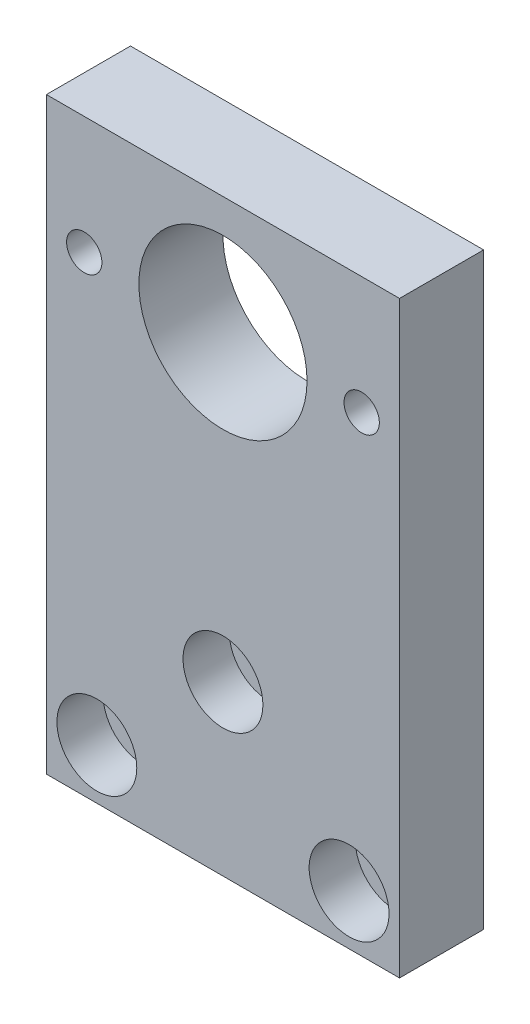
ISO-10303-21;
HEADER;
FILE_DESCRIPTION(('STEP AP214'),'2;1');
FILE_NAME('part.step','',(''),(''),'','','');
FILE_SCHEMA(('AUTOMOTIVE_DESIGN { 1 0 10303 214 1 1 1 1 }'));
ENDSEC;
DATA;
#1=APPLICATION_CONTEXT('core data for automotive mechanical design processes');
#2=APPLICATION_PROTOCOL_DEFINITION('international standard','automotive_design',2000,#1);
#3=PRODUCT_CONTEXT('',#1,'mechanical');
#4=PRODUCT('Part','Part','',(#3));
#5=PRODUCT_RELATED_PRODUCT_CATEGORY('part','',(#4));
#6=PRODUCT_DEFINITION_FORMATION('','',#4);
#7=PRODUCT_DEFINITION_CONTEXT('part definition',#1,'design');
#8=PRODUCT_DEFINITION('design','',#6,#7);
#9=PRODUCT_DEFINITION_SHAPE('','',#8);
#10=(LENGTH_UNIT() NAMED_UNIT(*) SI_UNIT(.MILLI.,.METRE.));
#11=(NAMED_UNIT(*) PLANE_ANGLE_UNIT() SI_UNIT($,.RADIAN.));
#12=(NAMED_UNIT(*) SI_UNIT($,.STERADIAN.) SOLID_ANGLE_UNIT());
#13=UNCERTAINTY_MEASURE_WITH_UNIT(LENGTH_MEASURE(1.E-05),#10,'distance_accuracy_value','');
#14=(GEOMETRIC_REPRESENTATION_CONTEXT(3) GLOBAL_UNCERTAINTY_ASSIGNED_CONTEXT((#13)) GLOBAL_UNIT_ASSIGNED_CONTEXT((#10,
#11,#12)) REPRESENTATION_CONTEXT('',''));
#15=CARTESIAN_POINT('',(0.,0.,0.));
#16=DIRECTION('',(0.,0.,1.));
#17=DIRECTION('',(1.,0.,0.));
#18=AXIS2_PLACEMENT_3D('',#15,#16,#17);
#19=CARTESIAN_POINT('',(21.,19.9999999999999,10.));
#20=DIRECTION('',(0.,0.,-1.));
#21=DIRECTION('',(-1.,0.,0.));
#22=AXIS2_PLACEMENT_3D('',#19,#20,#21);
#23=CYLINDRICAL_SURFACE('',#22,2.75);
#24=CARTESIAN_POINT('',(21.,19.9999999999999,0.));
#25=DIRECTION('',(0.,0.,1.));
#26=DIRECTION('',(1.,0.,0.));
#27=AXIS2_PLACEMENT_3D('',#24,#25,#26);
#28=CIRCLE('',#27,2.75);
#29=CARTESIAN_POINT('',(23.75,19.9999999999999,0.));
#30=VERTEX_POINT('',#29);
#31=EDGE_CURVE('E149',#30,#30,#28,.T.);
#32=ORIENTED_EDGE('',*,*,#31,.F.);
#33=EDGE_LOOP('',(#32));
#34=FACE_BOUND('',#33,.T.);
#35=CARTESIAN_POINT('',(21.,19.9999999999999,4.5));
#36=DIRECTION('',(0.,0.,1.));
#37=DIRECTION('',(1.,0.,0.));
#38=AXIS2_PLACEMENT_3D('',#35,#36,#37);
#39=CIRCLE('',#38,2.75);
#40=CARTESIAN_POINT('',(23.75,19.9999999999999,4.5));
#41=VERTEX_POINT('',#40);
#42=EDGE_CURVE('E36',#41,#41,#39,.T.);
#43=ORIENTED_EDGE('',*,*,#42,.T.);
#44=EDGE_LOOP('',(#43));
#45=FACE_BOUND('',#44,.T.);
#46=ADVANCED_FACE('F32',(#34,#45),#23,.F.);
#47=CARTESIAN_POINT('',(36.,5.99999999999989,10.));
#48=DIRECTION('',(0.,0.,-1.));
#49=DIRECTION('',(-1.,0.,0.));
#50=AXIS2_PLACEMENT_3D('',#47,#48,#49);
#51=CYLINDRICAL_SURFACE('',#50,2.75);
#52=CARTESIAN_POINT('',(36.,5.99999999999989,0.));
#53=DIRECTION('',(0.,0.,1.));
#54=DIRECTION('',(1.,0.,0.));
#55=AXIS2_PLACEMENT_3D('',#52,#53,#54);
#56=CIRCLE('',#55,2.75);
#57=CARTESIAN_POINT('',(38.75,5.99999999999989,0.));
#58=VERTEX_POINT('',#57);
#59=EDGE_CURVE('E154',#58,#58,#56,.T.);
#60=ORIENTED_EDGE('',*,*,#59,.F.);
#61=EDGE_LOOP('',(#60));
#62=FACE_BOUND('',#61,.T.);
#63=CARTESIAN_POINT('',(36.,5.99999999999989,4.5));
#64=DIRECTION('',(0.,0.,1.));
#65=DIRECTION('',(1.,0.,0.));
#66=AXIS2_PLACEMENT_3D('',#63,#64,#65);
#67=CIRCLE('',#66,2.75);
#68=CARTESIAN_POINT('',(38.75,5.99999999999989,4.5));
#69=VERTEX_POINT('',#68);
#70=EDGE_CURVE('E113',#69,#69,#67,.T.);
#71=ORIENTED_EDGE('',*,*,#70,.T.);
#72=EDGE_LOOP('',(#71));
#73=FACE_BOUND('',#72,.T.);
#74=ADVANCED_FACE('F166',(#62,#73),#51,.F.);
#75=CARTESIAN_POINT('',(6.,5.99999999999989,10.));
#76=DIRECTION('',(0.,0.,-1.));
#77=DIRECTION('',(-1.,0.,0.));
#78=AXIS2_PLACEMENT_3D('',#75,#76,#77);
#79=CYLINDRICAL_SURFACE('',#78,2.75);
#80=CARTESIAN_POINT('',(6.,5.99999999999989,0.));
#81=DIRECTION('',(0.,0.,1.));
#82=DIRECTION('',(1.,0.,0.));
#83=AXIS2_PLACEMENT_3D('',#80,#81,#82);
#84=CIRCLE('',#83,2.75);
#85=CARTESIAN_POINT('',(8.75,5.99999999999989,0.));
#86=VERTEX_POINT('',#85);
#87=EDGE_CURVE('E103',#86,#86,#84,.T.);
#88=ORIENTED_EDGE('',*,*,#87,.F.);
#89=EDGE_LOOP('',(#88));
#90=FACE_BOUND('',#89,.T.);
#91=CARTESIAN_POINT('',(6.,5.99999999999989,4.5));
#92=DIRECTION('',(0.,0.,1.));
#93=DIRECTION('',(1.,0.,0.));
#94=AXIS2_PLACEMENT_3D('',#91,#92,#93);
#95=CIRCLE('',#94,2.75);
#96=CARTESIAN_POINT('',(8.75,5.99999999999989,4.5));
#97=VERTEX_POINT('',#96);
#98=EDGE_CURVE('E109',#97,#97,#95,.T.);
#99=ORIENTED_EDGE('',*,*,#98,.T.);
#100=EDGE_LOOP('',(#99));
#101=FACE_BOUND('',#100,.T.);
#102=ADVANCED_FACE('F163',(#90,#101),#79,.F.);
#103=CARTESIAN_POINT('',(42.,-1.13686837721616E-13,10.));
#104=DIRECTION('',(0.,0.,1.));
#105=DIRECTION('',(1.,0.,0.));
#106=AXIS2_PLACEMENT_3D('',#103,#104,#105);
#107=PLANE('',#106);
#108=CARTESIAN_POINT('',(21.,19.9999999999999,10.));
#109=DIRECTION('',(0.,0.,1.));
#110=DIRECTION('',(1.,0.,0.));
#111=AXIS2_PLACEMENT_3D('',#108,#109,#110);
#112=CIRCLE('',#111,4.75);
#113=CARTESIAN_POINT('',(25.75,19.9999999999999,10.));
#114=VERTEX_POINT('',#113);
#115=EDGE_CURVE('E129',#114,#114,#112,.T.);
#116=ORIENTED_EDGE('',*,*,#115,.F.);
#117=EDGE_LOOP('',(#116));
#118=FACE_BOUND('',#117,.T.);
#119=CARTESIAN_POINT('',(36.,5.99999999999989,10.));
#120=DIRECTION('',(0.,0.,1.));
#121=DIRECTION('',(1.,0.,0.));
#122=AXIS2_PLACEMENT_3D('',#119,#120,#121);
#123=CIRCLE('',#122,4.75);
#124=CARTESIAN_POINT('',(40.75,5.99999999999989,10.));
#125=VERTEX_POINT('',#124);
#126=EDGE_CURVE('E122',#125,#125,#123,.T.);
#127=ORIENTED_EDGE('',*,*,#126,.F.);
#128=EDGE_LOOP('',(#127));
#129=FACE_BOUND('',#128,.T.);
#130=CARTESIAN_POINT('',(6.,5.99999999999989,10.));
#131=DIRECTION('',(0.,0.,1.));
#132=DIRECTION('',(1.,0.,0.));
#133=AXIS2_PLACEMENT_3D('',#130,#131,#132);
#134=CIRCLE('',#133,4.75);
#135=CARTESIAN_POINT('',(10.75,5.99999999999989,10.));
#136=VERTEX_POINT('',#135);
#137=EDGE_CURVE('E115',#136,#136,#134,.T.);
#138=ORIENTED_EDGE('',*,*,#137,.F.);
#139=EDGE_LOOP('',(#138));
#140=FACE_BOUND('',#139,.T.);
#141=CARTESIAN_POINT('',(37.5,55.9999999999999,10.));
#142=DIRECTION('',(0.,0.,1.));
#143=DIRECTION('',(1.,0.,0.));
#144=AXIS2_PLACEMENT_3D('',#141,#142,#143);
#145=CIRCLE('',#144,2.1);
#146=CARTESIAN_POINT('',(39.6,55.9999999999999,10.));
#147=VERTEX_POINT('',#146);
#148=EDGE_CURVE('E140',#147,#147,#145,.T.);
#149=ORIENTED_EDGE('',*,*,#148,.F.);
#150=EDGE_LOOP('',(#149));
#151=FACE_BOUND('',#150,.T.);
#152=DIRECTION('',(1.,0.,0.));
#153=VECTOR('',#152,1.);
#154=CARTESIAN_POINT('',(0.,-1.13686837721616E-13,10.));
#155=LINE('',#154,#153);
#156=CARTESIAN_POINT('',(0.,-1.13686837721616E-13,10.));
#157=VERTEX_POINT('',#156);
#158=CARTESIAN_POINT('',(42.,-1.13686837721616E-13,10.));
#159=VERTEX_POINT('',#158);
#160=EDGE_CURVE('E87',#157,#159,#155,.T.);
#161=ORIENTED_EDGE('',*,*,#160,.T.);
#162=DIRECTION('',(0.,1.,0.));
#163=VECTOR('',#162,1.);
#164=CARTESIAN_POINT('',(42.,-1.13686837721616E-13,10.));
#165=LINE('',#164,#163);
#166=CARTESIAN_POINT('',(42.,69.9999999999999,10.));
#167=VERTEX_POINT('',#166);
#168=EDGE_CURVE('E81',#159,#167,#165,.T.);
#169=ORIENTED_EDGE('',*,*,#168,.T.);
#170=DIRECTION('',(-1.,0.,0.));
#171=VECTOR('',#170,1.);
#172=CARTESIAN_POINT('',(0.,69.9999999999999,10.));
#173=LINE('',#172,#171);
#174=CARTESIAN_POINT('',(0.,69.9999999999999,10.));
#175=VERTEX_POINT('',#174);
#176=EDGE_CURVE('E85',#167,#175,#173,.T.);
#177=ORIENTED_EDGE('',*,*,#176,.T.);
#178=DIRECTION('',(0.,-1.,0.));
#179=VECTOR('',#178,1.);
#180=CARTESIAN_POINT('',(0.,-1.13686837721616E-13,10.));
#181=LINE('',#180,#179);
#182=EDGE_CURVE('E51',#175,#157,#181,.T.);
#183=ORIENTED_EDGE('',*,*,#182,.T.);
#184=EDGE_LOOP('',(#161,#169,#177,#183));
#185=FACE_BOUND('',#184,.T.);
#186=CARTESIAN_POINT('',(4.5,55.9999999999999,10.));
#187=DIRECTION('',(0.,0.,1.));
#188=DIRECTION('',(1.,0.,0.));
#189=AXIS2_PLACEMENT_3D('',#186,#187,#188);
#190=CIRCLE('',#189,2.1);
#191=CARTESIAN_POINT('',(6.6,55.9999999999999,10.));
#192=VERTEX_POINT('',#191);
#193=EDGE_CURVE('E146',#192,#192,#190,.T.);
#194=ORIENTED_EDGE('',*,*,#193,.F.);
#195=EDGE_LOOP('',(#194));
#196=FACE_BOUND('',#195,.T.);
#197=CARTESIAN_POINT('',(21.,55.9999999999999,10.));
#198=DIRECTION('',(0.,0.,1.));
#199=DIRECTION('',(1.,0.,0.));
#200=AXIS2_PLACEMENT_3D('',#197,#198,#199);
#201=CIRCLE('',#200,10.);
#202=CARTESIAN_POINT('',(31.,55.9999999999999,10.));
#203=VERTEX_POINT('',#202);
#204=EDGE_CURVE('E134',#203,#203,#201,.T.);
#205=ORIENTED_EDGE('',*,*,#204,.F.);
#206=EDGE_LOOP('',(#205));
#207=FACE_BOUND('',#206,.T.);
#208=ADVANCED_FACE('F82',(#118,#129,#140,#151,#185,#196,#207),#107,.T.);
#209=CARTESIAN_POINT('',(42.,-1.13686837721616E-13,0.));
#210=DIRECTION('',(0.,0.,1.));
#211=DIRECTION('',(1.,0.,0.));
#212=AXIS2_PLACEMENT_3D('',#209,#210,#211);
#213=PLANE('',#212);
#214=CARTESIAN_POINT('',(37.5,55.9999999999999,0.));
#215=DIRECTION('',(0.,0.,1.));
#216=DIRECTION('',(1.,0.,0.));
#217=AXIS2_PLACEMENT_3D('',#214,#215,#216);
#218=CIRCLE('',#217,2.1);
#219=CARTESIAN_POINT('',(39.6,55.9999999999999,0.));
#220=VERTEX_POINT('',#219);
#221=EDGE_CURVE('E137',#220,#220,#218,.T.);
#222=ORIENTED_EDGE('',*,*,#221,.T.);
#223=EDGE_LOOP('',(#222));
#224=FACE_BOUND('',#223,.T.);
#225=ORIENTED_EDGE('',*,*,#31,.T.);
#226=EDGE_LOOP('',(#225));
#227=FACE_BOUND('',#226,.T.);
#228=ORIENTED_EDGE('',*,*,#87,.T.);
#229=EDGE_LOOP('',(#228));
#230=FACE_BOUND('',#229,.T.);
#231=DIRECTION('',(1.,0.,0.));
#232=VECTOR('',#231,1.);
#233=CARTESIAN_POINT('',(0.,-1.13686837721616E-13,0.));
#234=LINE('',#233,#232);
#235=CARTESIAN_POINT('',(0.,-1.13686837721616E-13,0.));
#236=VERTEX_POINT('',#235);
#237=CARTESIAN_POINT('',(42.,-1.13686837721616E-13,0.));
#238=VERTEX_POINT('',#237);
#239=EDGE_CURVE('E100',#236,#238,#234,.T.);
#240=ORIENTED_EDGE('',*,*,#239,.F.);
#241=DIRECTION('',(0.,-1.,0.));
#242=VECTOR('',#241,1.);
#243=CARTESIAN_POINT('',(0.,-1.13686837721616E-13,0.));
#244=LINE('',#243,#242);
#245=CARTESIAN_POINT('',(0.,69.9999999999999,0.));
#246=VERTEX_POINT('',#245);
#247=EDGE_CURVE('E74',#246,#236,#244,.T.);
#248=ORIENTED_EDGE('',*,*,#247,.F.);
#249=DIRECTION('',(-1.,0.,0.));
#250=VECTOR('',#249,1.);
#251=CARTESIAN_POINT('',(0.,69.9999999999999,0.));
#252=LINE('',#251,#250);
#253=CARTESIAN_POINT('',(42.,69.9999999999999,0.));
#254=VERTEX_POINT('',#253);
#255=EDGE_CURVE('E68',#254,#246,#252,.T.);
#256=ORIENTED_EDGE('',*,*,#255,.F.);
#257=DIRECTION('',(0.,1.,0.));
#258=VECTOR('',#257,1.);
#259=CARTESIAN_POINT('',(42.,-1.13686837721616E-13,0.));
#260=LINE('',#259,#258);
#261=EDGE_CURVE('E91',#238,#254,#260,.T.);
#262=ORIENTED_EDGE('',*,*,#261,.F.);
#263=EDGE_LOOP('',(#240,#248,#256,#262));
#264=FACE_BOUND('',#263,.T.);
#265=ORIENTED_EDGE('',*,*,#59,.T.);
#266=EDGE_LOOP('',(#265));
#267=FACE_BOUND('',#266,.T.);
#268=CARTESIAN_POINT('',(4.5,55.9999999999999,0.));
#269=DIRECTION('',(0.,0.,1.));
#270=DIRECTION('',(1.,0.,0.));
#271=AXIS2_PLACEMENT_3D('',#268,#269,#270);
#272=CIRCLE('',#271,2.1);
#273=CARTESIAN_POINT('',(6.6,55.9999999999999,0.));
#274=VERTEX_POINT('',#273);
#275=EDGE_CURVE('E143',#274,#274,#272,.T.);
#276=ORIENTED_EDGE('',*,*,#275,.T.);
#277=EDGE_LOOP('',(#276));
#278=FACE_BOUND('',#277,.T.);
#279=CARTESIAN_POINT('',(21.,55.9999999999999,0.));
#280=DIRECTION('',(0.,0.,1.));
#281=DIRECTION('',(1.,0.,0.));
#282=AXIS2_PLACEMENT_3D('',#279,#280,#281);
#283=CIRCLE('',#282,10.);
#284=CARTESIAN_POINT('',(31.,55.9999999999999,0.));
#285=VERTEX_POINT('',#284);
#286=EDGE_CURVE('E111',#285,#285,#283,.T.);
#287=ORIENTED_EDGE('',*,*,#286,.T.);
#288=EDGE_LOOP('',(#287));
#289=FACE_BOUND('',#288,.T.);
#290=ADVANCED_FACE('F160',(#224,#227,#230,#264,#267,#278,#289),#213,.F.);
#291=CARTESIAN_POINT('',(0.,-1.13686837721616E-13,10.));
#292=DIRECTION('',(0.,1.,0.));
#293=DIRECTION('',(0.,0.,1.));
#294=AXIS2_PLACEMENT_3D('',#291,#292,#293);
#295=PLANE('',#294);
#296=ORIENTED_EDGE('',*,*,#239,.T.);
#297=DIRECTION('',(0.,0.,-1.));
#298=VECTOR('',#297,1.);
#299=CARTESIAN_POINT('',(42.,-1.13686837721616E-13,10.));
#300=LINE('',#299,#298);
#301=EDGE_CURVE('E11',#159,#238,#300,.T.);
#302=ORIENTED_EDGE('',*,*,#301,.F.);
#303=ORIENTED_EDGE('',*,*,#160,.F.);
#304=DIRECTION('',(0.,0.,-1.));
#305=VECTOR('',#304,1.);
#306=CARTESIAN_POINT('',(0.,-1.13686837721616E-13,10.));
#307=LINE('',#306,#305);
#308=EDGE_CURVE('E96',#157,#236,#307,.T.);
#309=ORIENTED_EDGE('',*,*,#308,.T.);
#310=EDGE_LOOP('',(#296,#302,#303,#309));
#311=FACE_BOUND('',#310,.T.);
#312=ADVANCED_FACE('F34',(#311),#295,.F.);
#313=CARTESIAN_POINT('',(42.,-1.13686837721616E-13,10.));
#314=DIRECTION('',(-1.,0.,0.));
#315=DIRECTION('',(0.,0.,1.));
#316=AXIS2_PLACEMENT_3D('',#313,#314,#315);
#317=PLANE('',#316);
#318=ORIENTED_EDGE('',*,*,#261,.T.);
#319=DIRECTION('',(0.,0.,-1.));
#320=VECTOR('',#319,1.);
#321=CARTESIAN_POINT('',(42.,69.9999999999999,10.));
#322=LINE('',#321,#320);
#323=EDGE_CURVE('E42',#167,#254,#322,.T.);
#324=ORIENTED_EDGE('',*,*,#323,.F.);
#325=ORIENTED_EDGE('',*,*,#168,.F.);
#326=ORIENTED_EDGE('',*,*,#301,.T.);
#327=EDGE_LOOP('',(#318,#324,#325,#326));
#328=FACE_BOUND('',#327,.T.);
#329=ADVANCED_FACE('F90',(#328),#317,.F.);
#330=CARTESIAN_POINT('',(0.,69.9999999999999,10.));
#331=DIRECTION('',(0.,-1.,0.));
#332=DIRECTION('',(0.,0.,-1.));
#333=AXIS2_PLACEMENT_3D('',#330,#331,#332);
#334=PLANE('',#333);
#335=ORIENTED_EDGE('',*,*,#255,.T.);
#336=DIRECTION('',(0.,0.,-1.));
#337=VECTOR('',#336,1.);
#338=CARTESIAN_POINT('',(0.,69.9999999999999,10.));
#339=LINE('',#338,#337);
#340=EDGE_CURVE('E92',#175,#246,#339,.T.);
#341=ORIENTED_EDGE('',*,*,#340,.F.);
#342=ORIENTED_EDGE('',*,*,#176,.F.);
#343=ORIENTED_EDGE('',*,*,#323,.T.);
#344=EDGE_LOOP('',(#335,#341,#342,#343));
#345=FACE_BOUND('',#344,.T.);
#346=ADVANCED_FACE('F94',(#345),#334,.F.);
#347=CARTESIAN_POINT('',(0.,-1.13686837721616E-13,10.));
#348=DIRECTION('',(1.,0.,0.));
#349=DIRECTION('',(0.,0.,-1.));
#350=AXIS2_PLACEMENT_3D('',#347,#348,#349);
#351=PLANE('',#350);
#352=ORIENTED_EDGE('',*,*,#247,.T.);
#353=ORIENTED_EDGE('',*,*,#308,.F.);
#354=ORIENTED_EDGE('',*,*,#182,.F.);
#355=ORIENTED_EDGE('',*,*,#340,.T.);
#356=EDGE_LOOP('',(#352,#353,#354,#355));
#357=FACE_BOUND('',#356,.T.);
#358=ADVANCED_FACE('F234',(#357),#351,.F.);
#359=CARTESIAN_POINT('',(4.5,55.9999999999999,10.));
#360=DIRECTION('',(0.,0.,-1.));
#361=DIRECTION('',(-1.,0.,0.));
#362=AXIS2_PLACEMENT_3D('',#359,#360,#361);
#363=CYLINDRICAL_SURFACE('',#362,2.1);
#364=ORIENTED_EDGE('',*,*,#193,.T.);
#365=EDGE_LOOP('',(#364));
#366=FACE_BOUND('',#365,.T.);
#367=ORIENTED_EDGE('',*,*,#275,.F.);
#368=EDGE_LOOP('',(#367));
#369=FACE_BOUND('',#368,.T.);
#370=ADVANCED_FACE('F193',(#366,#369),#363,.F.);
#371=CARTESIAN_POINT('',(37.5,55.9999999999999,10.));
#372=DIRECTION('',(0.,0.,-1.));
#373=DIRECTION('',(-1.,0.,0.));
#374=AXIS2_PLACEMENT_3D('',#371,#372,#373);
#375=CYLINDRICAL_SURFACE('',#374,2.1);
#376=ORIENTED_EDGE('',*,*,#148,.T.);
#377=EDGE_LOOP('',(#376));
#378=FACE_BOUND('',#377,.T.);
#379=ORIENTED_EDGE('',*,*,#221,.F.);
#380=EDGE_LOOP('',(#379));
#381=FACE_BOUND('',#380,.T.);
#382=ADVANCED_FACE('F190',(#378,#381),#375,.F.);
#383=CARTESIAN_POINT('',(21.,55.9999999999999,10.));
#384=DIRECTION('',(0.,0.,-1.));
#385=DIRECTION('',(-1.,0.,0.));
#386=AXIS2_PLACEMENT_3D('',#383,#384,#385);
#387=CYLINDRICAL_SURFACE('',#386,10.);
#388=ORIENTED_EDGE('',*,*,#204,.T.);
#389=EDGE_LOOP('',(#388));
#390=FACE_BOUND('',#389,.T.);
#391=ORIENTED_EDGE('',*,*,#286,.F.);
#392=EDGE_LOOP('',(#391));
#393=FACE_BOUND('',#392,.T.);
#394=ADVANCED_FACE('F180',(#390,#393),#387,.F.);
#395=CARTESIAN_POINT('',(6.,5.99999999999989,4.5));
#396=DIRECTION('',(0.,0.,1.));
#397=DIRECTION('',(1.,0.,0.));
#398=AXIS2_PLACEMENT_3D('',#395,#396,#397);
#399=CYLINDRICAL_SURFACE('',#398,4.75);
#400=CARTESIAN_POINT('',(6.,5.99999999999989,4.5));
#401=DIRECTION('',(0.,0.,1.));
#402=DIRECTION('',(1.,0.,0.));
#403=AXIS2_PLACEMENT_3D('',#400,#401,#402);
#404=CIRCLE('',#403,4.75);
#405=CARTESIAN_POINT('',(10.75,5.99999999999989,4.5));
#406=VERTEX_POINT('',#405);
#407=EDGE_CURVE('E112',#406,#406,#404,.T.);
#408=ORIENTED_EDGE('',*,*,#407,.F.);
#409=EDGE_LOOP('',(#408));
#410=FACE_BOUND('',#409,.T.);
#411=ORIENTED_EDGE('',*,*,#137,.T.);
#412=EDGE_LOOP('',(#411));
#413=FACE_BOUND('',#412,.T.);
#414=ADVANCED_FACE('F174',(#410,#413),#399,.F.);
#415=CARTESIAN_POINT('',(6.,5.99999999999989,4.5));
#416=DIRECTION('',(0.,0.,1.));
#417=DIRECTION('',(1.,0.,0.));
#418=AXIS2_PLACEMENT_3D('',#415,#416,#417);
#419=PLANE('',#418);
#420=ORIENTED_EDGE('',*,*,#98,.F.);
#421=EDGE_LOOP('',(#420));
#422=FACE_BOUND('',#421,.T.);
#423=ORIENTED_EDGE('',*,*,#407,.T.);
#424=EDGE_LOOP('',(#423));
#425=FACE_BOUND('',#424,.T.);
#426=ADVANCED_FACE('F170',(#422,#425),#419,.T.);
#427=CARTESIAN_POINT('',(36.,5.99999999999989,4.5));
#428=DIRECTION('',(0.,0.,1.));
#429=DIRECTION('',(1.,0.,0.));
#430=AXIS2_PLACEMENT_3D('',#427,#428,#429);
#431=CYLINDRICAL_SURFACE('',#430,4.75);
#432=CARTESIAN_POINT('',(36.,5.99999999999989,4.5));
#433=DIRECTION('',(0.,0.,1.));
#434=DIRECTION('',(1.,0.,0.));
#435=AXIS2_PLACEMENT_3D('',#432,#433,#434);
#436=CIRCLE('',#435,4.75);
#437=CARTESIAN_POINT('',(40.75,5.99999999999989,4.5));
#438=VERTEX_POINT('',#437);
#439=EDGE_CURVE('E116',#438,#438,#436,.T.);
#440=ORIENTED_EDGE('',*,*,#439,.F.);
#441=EDGE_LOOP('',(#440));
#442=FACE_BOUND('',#441,.T.);
#443=ORIENTED_EDGE('',*,*,#126,.T.);
#444=EDGE_LOOP('',(#443));
#445=FACE_BOUND('',#444,.T.);
#446=ADVANCED_FACE('F173',(#442,#445),#431,.F.);
#447=CARTESIAN_POINT('',(36.,5.99999999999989,4.5));
#448=DIRECTION('',(0.,0.,1.));
#449=DIRECTION('',(1.,0.,0.));
#450=AXIS2_PLACEMENT_3D('',#447,#448,#449);
#451=PLANE('',#450);
#452=ORIENTED_EDGE('',*,*,#70,.F.);
#453=EDGE_LOOP('',(#452));
#454=FACE_BOUND('',#453,.T.);
#455=ORIENTED_EDGE('',*,*,#439,.T.);
#456=EDGE_LOOP('',(#455));
#457=FACE_BOUND('',#456,.T.);
#458=ADVANCED_FACE('F220',(#454,#457),#451,.T.);
#459=CARTESIAN_POINT('',(21.,19.9999999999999,4.5));
#460=DIRECTION('',(0.,0.,1.));
#461=DIRECTION('',(1.,0.,0.));
#462=AXIS2_PLACEMENT_3D('',#459,#460,#461);
#463=CYLINDRICAL_SURFACE('',#462,4.75);
#464=CARTESIAN_POINT('',(21.,19.9999999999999,4.5));
#465=DIRECTION('',(0.,0.,1.));
#466=DIRECTION('',(1.,0.,0.));
#467=AXIS2_PLACEMENT_3D('',#464,#465,#466);
#468=CIRCLE('',#467,4.75);
#469=CARTESIAN_POINT('',(25.75,19.9999999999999,4.5));
#470=VERTEX_POINT('',#469);
#471=EDGE_CURVE('E208',#470,#470,#468,.T.);
#472=ORIENTED_EDGE('',*,*,#471,.F.);
#473=EDGE_LOOP('',(#472));
#474=FACE_BOUND('',#473,.T.);
#475=ORIENTED_EDGE('',*,*,#115,.T.);
#476=EDGE_LOOP('',(#475));
#477=FACE_BOUND('',#476,.T.);
#478=ADVANCED_FACE('F215',(#474,#477),#463,.F.);
#479=CARTESIAN_POINT('',(21.,19.9999999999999,4.5));
#480=DIRECTION('',(0.,0.,1.));
#481=DIRECTION('',(1.,0.,0.));
#482=AXIS2_PLACEMENT_3D('',#479,#480,#481);
#483=PLANE('',#482);
#484=ORIENTED_EDGE('',*,*,#42,.F.);
#485=EDGE_LOOP('',(#484));
#486=FACE_BOUND('',#485,.T.);
#487=ORIENTED_EDGE('',*,*,#471,.T.);
#488=EDGE_LOOP('',(#487));
#489=FACE_BOUND('',#488,.T.);
#490=ADVANCED_FACE('F348',(#486,#489),#483,.T.);
#491=CLOSED_SHELL('',(#46,#74,#102,#208,#290,#312,#329,#346,#358,#370,#382,#394,#414,#426,#446,
#458,#478,#490));
#492=MANIFOLD_SOLID_BREP('B2',#491);
#493=ADVANCED_BREP_SHAPE_REPRESENTATION('',(#18,#492),#14);
#494=SHAPE_DEFINITION_REPRESENTATION(#9,#493);
ENDSEC;
END-ISO-10303-21;
